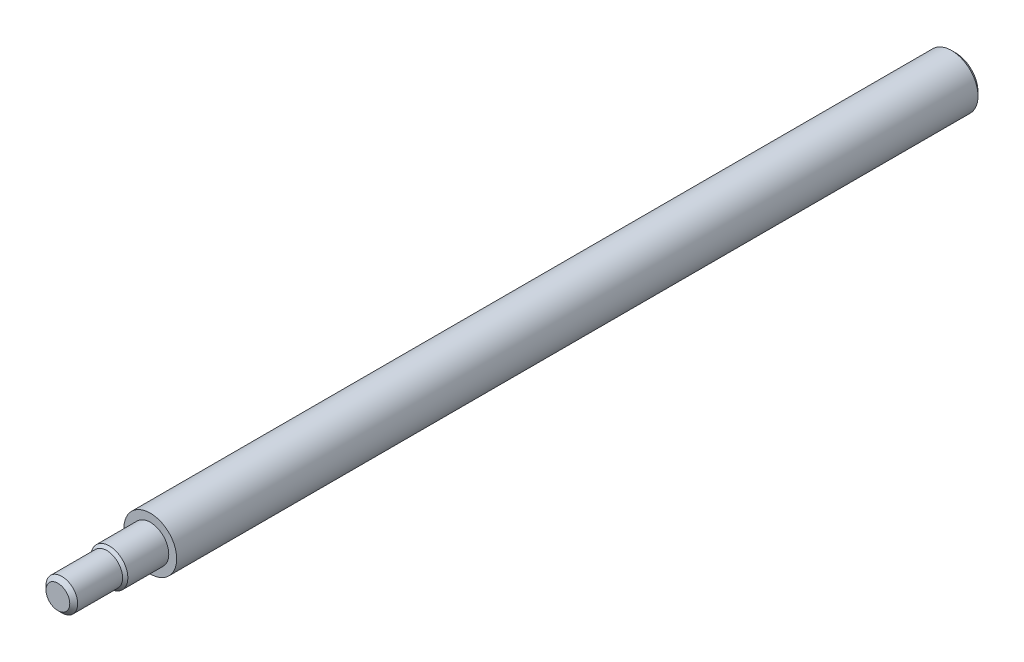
ISO-10303-21;
HEADER;
FILE_DESCRIPTION(('STEP AP214'),'2;1');
FILE_NAME('part.step','',(''),(''),'','','');
FILE_SCHEMA(('AUTOMOTIVE_DESIGN { 1 0 10303 214 1 1 1 1 }'));
ENDSEC;
DATA;
#1=APPLICATION_CONTEXT('core data for automotive mechanical design processes');
#2=APPLICATION_PROTOCOL_DEFINITION('international standard','automotive_design',2000,#1);
#3=PRODUCT_CONTEXT('',#1,'mechanical');
#4=PRODUCT('Part','Part','',(#3));
#5=PRODUCT_RELATED_PRODUCT_CATEGORY('part','',(#4));
#6=PRODUCT_DEFINITION_FORMATION('','',#4);
#7=PRODUCT_DEFINITION_CONTEXT('part definition',#1,'design');
#8=PRODUCT_DEFINITION('design','',#6,#7);
#9=PRODUCT_DEFINITION_SHAPE('','',#8);
#10=(LENGTH_UNIT() NAMED_UNIT(*) SI_UNIT(.MILLI.,.METRE.));
#11=(NAMED_UNIT(*) PLANE_ANGLE_UNIT() SI_UNIT($,.RADIAN.));
#12=(NAMED_UNIT(*) SI_UNIT($,.STERADIAN.) SOLID_ANGLE_UNIT());
#13=UNCERTAINTY_MEASURE_WITH_UNIT(LENGTH_MEASURE(1.E-05),#10,'distance_accuracy_value','');
#14=(GEOMETRIC_REPRESENTATION_CONTEXT(3) GLOBAL_UNCERTAINTY_ASSIGNED_CONTEXT((#13)) GLOBAL_UNIT_ASSIGNED_CONTEXT((#10,
#11,#12)) REPRESENTATION_CONTEXT('',''));
#15=CARTESIAN_POINT('',(0.,0.,0.));
#16=DIRECTION('',(0.,0.,1.));
#17=DIRECTION('',(1.,0.,0.));
#18=AXIS2_PLACEMENT_3D('',#15,#16,#17);
#19=CARTESIAN_POINT('',(0.,0.,305.));
#20=DIRECTION('',(0.,0.,-1.));
#21=DIRECTION('',(-1.,0.,0.));
#22=AXIS2_PLACEMENT_3D('',#19,#20,#21);
#23=CYLINDRICAL_SURFACE('',#22,10.);
#24=CARTESIAN_POINT('',(0.,0.,1.50000000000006));
#25=DIRECTION('',(0.,0.,1.));
#26=DIRECTION('',(1.,0.,0.));
#27=AXIS2_PLACEMENT_3D('',#24,#25,#26);
#28=CIRCLE('',#27,10.);
#29=CARTESIAN_POINT('',(10.,0.,1.50000000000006));
#30=VERTEX_POINT('',#29);
#31=EDGE_CURVE('E58',#30,#30,#28,.T.);
#32=ORIENTED_EDGE('',*,*,#31,.T.);
#33=EDGE_LOOP('',(#32));
#34=FACE_BOUND('',#33,.T.);
#35=CARTESIAN_POINT('',(0.,0.,305.));
#36=DIRECTION('',(0.,0.,1.));
#37=DIRECTION('',(1.,0.,0.));
#38=AXIS2_PLACEMENT_3D('',#35,#36,#37);
#39=CIRCLE('',#38,10.);
#40=CARTESIAN_POINT('',(10.,0.,305.));
#41=VERTEX_POINT('',#40);
#42=EDGE_CURVE('E61',#41,#41,#39,.T.);
#43=ORIENTED_EDGE('',*,*,#42,.F.);
#44=EDGE_LOOP('',(#43));
#45=FACE_BOUND('',#44,.T.);
#46=ADVANCED_FACE('F35',(#34,#45),#23,.T.);
#47=CARTESIAN_POINT('',(0.,0.,305.));
#48=DIRECTION('',(0.,0.,1.));
#49=DIRECTION('',(1.,0.,0.));
#50=AXIS2_PLACEMENT_3D('',#47,#48,#49);
#51=PLANE('',#50);
#52=CARTESIAN_POINT('',(0.,0.,305.));
#53=DIRECTION('',(0.,0.,1.));
#54=DIRECTION('',(1.,0.,0.));
#55=AXIS2_PLACEMENT_3D('',#52,#53,#54);
#56=CIRCLE('',#55,7.);
#57=CARTESIAN_POINT('',(7.,0.,305.));
#58=VERTEX_POINT('',#57);
#59=EDGE_CURVE('E64',#58,#58,#56,.T.);
#60=ORIENTED_EDGE('',*,*,#59,.F.);
#61=EDGE_LOOP('',(#60));
#62=FACE_BOUND('',#61,.T.);
#63=ORIENTED_EDGE('',*,*,#42,.T.);
#64=EDGE_LOOP('',(#63));
#65=FACE_BOUND('',#64,.T.);
#66=ADVANCED_FACE('F70',(#62,#65),#51,.T.);
#67=CARTESIAN_POINT('',(0.,0.,0.));
#68=DIRECTION('',(0.,0.,1.));
#69=DIRECTION('',(1.,0.,0.));
#70=AXIS2_PLACEMENT_3D('',#67,#68,#69);
#71=PLANE('',#70);
#72=CARTESIAN_POINT('',(0.,0.,0.));
#73=DIRECTION('',(0.,0.,1.));
#74=DIRECTION('',(1.,0.,0.));
#75=AXIS2_PLACEMENT_3D('',#72,#73,#74);
#76=CIRCLE('',#75,8.49999999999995);
#77=CARTESIAN_POINT('',(8.49999999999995,0.,0.));
#78=VERTEX_POINT('',#77);
#79=EDGE_CURVE('E55',#78,#78,#76,.F.);
#80=ORIENTED_EDGE('',*,*,#79,.T.);
#81=EDGE_LOOP('',(#80));
#82=FACE_BOUND('',#81,.T.);
#83=ADVANCED_FACE('F73',(#82),#71,.F.);
#84=CARTESIAN_POINT('',(0.,0.,322.));
#85=DIRECTION('',(0.,0.,-1.));
#86=DIRECTION('',(-1.,0.,0.));
#87=AXIS2_PLACEMENT_3D('',#84,#85,#86);
#88=CYLINDRICAL_SURFACE('',#87,7.);
#89=CARTESIAN_POINT('',(0.,0.,320.5));
#90=DIRECTION('',(0.,0.,1.));
#91=DIRECTION('',(1.,0.,0.));
#92=AXIS2_PLACEMENT_3D('',#89,#90,#91);
#93=CIRCLE('',#92,7.);
#94=CARTESIAN_POINT('',(7.,0.,320.5));
#95=VERTEX_POINT('',#94);
#96=EDGE_CURVE('E50',#95,#95,#93,.F.);
#97=ORIENTED_EDGE('',*,*,#96,.T.);
#98=EDGE_LOOP('',(#97));
#99=FACE_BOUND('',#98,.T.);
#100=ORIENTED_EDGE('',*,*,#59,.T.);
#101=EDGE_LOOP('',(#100));
#102=FACE_BOUND('',#101,.T.);
#103=ADVANCED_FACE('F68',(#99,#102),#88,.T.);
#104=CARTESIAN_POINT('',(0.,0.,340.));
#105=DIRECTION('',(0.,0.,-1.));
#106=DIRECTION('',(-1.,0.,0.));
#107=AXIS2_PLACEMENT_3D('',#104,#105,#106);
#108=CYLINDRICAL_SURFACE('',#107,6.);
#109=CARTESIAN_POINT('',(0.,0.,321.5));
#110=DIRECTION('',(0.,0.,-1.));
#111=DIRECTION('',(-1.,0.,0.));
#112=AXIS2_PLACEMENT_3D('',#109,#110,#111);
#113=CIRCLE('',#112,6.);
#114=CARTESIAN_POINT('',(-6.,0.,321.5));
#115=VERTEX_POINT('',#114);
#116=EDGE_CURVE('E10',#115,#115,#113,.F.);
#117=ORIENTED_EDGE('',*,*,#116,.T.);
#118=EDGE_LOOP('',(#117));
#119=FACE_BOUND('',#118,.T.);
#120=CARTESIAN_POINT('',(0.,0.,338.5));
#121=DIRECTION('',(0.,0.,1.));
#122=DIRECTION('',(1.,0.,0.));
#123=AXIS2_PLACEMENT_3D('',#120,#121,#122);
#124=CIRCLE('',#123,6.);
#125=CARTESIAN_POINT('',(6.,0.,338.5));
#126=VERTEX_POINT('',#125);
#127=EDGE_CURVE('E42',#126,#126,#124,.F.);
#128=ORIENTED_EDGE('',*,*,#127,.T.);
#129=EDGE_LOOP('',(#128));
#130=FACE_BOUND('',#129,.T.);
#131=ADVANCED_FACE('F99',(#119,#130),#108,.T.);
#132=CARTESIAN_POINT('',(0.,0.,340.));
#133=DIRECTION('',(0.,0.,1.));
#134=DIRECTION('',(1.,0.,0.));
#135=AXIS2_PLACEMENT_3D('',#132,#133,#134);
#136=PLANE('',#135);
#137=CARTESIAN_POINT('',(0.,0.,340.));
#138=DIRECTION('',(0.,0.,1.));
#139=DIRECTION('',(1.,0.,0.));
#140=AXIS2_PLACEMENT_3D('',#137,#138,#139);
#141=CIRCLE('',#140,4.50000000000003);
#142=CARTESIAN_POINT('',(4.50000000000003,0.,340.));
#143=VERTEX_POINT('',#142);
#144=EDGE_CURVE('E46',#143,#143,#141,.T.);
#145=ORIENTED_EDGE('',*,*,#144,.T.);
#146=EDGE_LOOP('',(#145));
#147=FACE_BOUND('',#146,.T.);
#148=ADVANCED_FACE('F87',(#147),#136,.T.);
#149=CARTESIAN_POINT('',(0.,0.,1.50000000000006));
#150=DIRECTION('',(0.,0.,1.));
#151=DIRECTION('',(1.,0.,0.));
#152=AXIS2_PLACEMENT_3D('',#149,#150,#151);
#153=CONICAL_SURFACE('',#152,10.,0.785398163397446);
#154=ORIENTED_EDGE('',*,*,#79,.F.);
#155=EDGE_LOOP('',(#154));
#156=FACE_BOUND('',#155,.T.);
#157=ORIENTED_EDGE('',*,*,#31,.F.);
#158=EDGE_LOOP('',(#157));
#159=FACE_BOUND('',#158,.T.);
#160=ADVANCED_FACE('F84',(#156,#159),#153,.T.);
#161=CARTESIAN_POINT('',(0.,0.,322.));
#162=DIRECTION('',(0.,0.,-1.));
#163=DIRECTION('',(-1.,0.,0.));
#164=AXIS2_PLACEMENT_3D('',#161,#162,#163);
#165=CONICAL_SURFACE('',#164,5.49999999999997,0.785398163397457);
#166=ORIENTED_EDGE('',*,*,#96,.F.);
#167=EDGE_LOOP('',(#166));
#168=FACE_BOUND('',#167,.T.);
#169=ORIENTED_EDGE('',*,*,#116,.F.);
#170=EDGE_LOOP('',(#169));
#171=FACE_BOUND('',#170,.T.);
#172=ADVANCED_FACE('F86',(#168,#171),#165,.T.);
#173=CARTESIAN_POINT('',(0.,0.,340.));
#174=DIRECTION('',(0.,0.,-1.));
#175=DIRECTION('',(-1.,0.,0.));
#176=AXIS2_PLACEMENT_3D('',#173,#174,#175);
#177=CONICAL_SURFACE('',#176,4.50000000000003,0.785398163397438);
#178=ORIENTED_EDGE('',*,*,#127,.F.);
#179=EDGE_LOOP('',(#178));
#180=FACE_BOUND('',#179,.T.);
#181=ORIENTED_EDGE('',*,*,#144,.F.);
#182=EDGE_LOOP('',(#181));
#183=FACE_BOUND('',#182,.T.);
#184=ADVANCED_FACE('F37',(#180,#183),#177,.T.);
#185=CLOSED_SHELL('',(#46,#66,#83,#103,#131,#148,#160,#172,#184));
#186=MANIFOLD_SOLID_BREP('B2',#185);
#187=ADVANCED_BREP_SHAPE_REPRESENTATION('',(#18,#186),#14);
#188=SHAPE_DEFINITION_REPRESENTATION(#9,#187);
ENDSEC;
END-ISO-10303-21;
